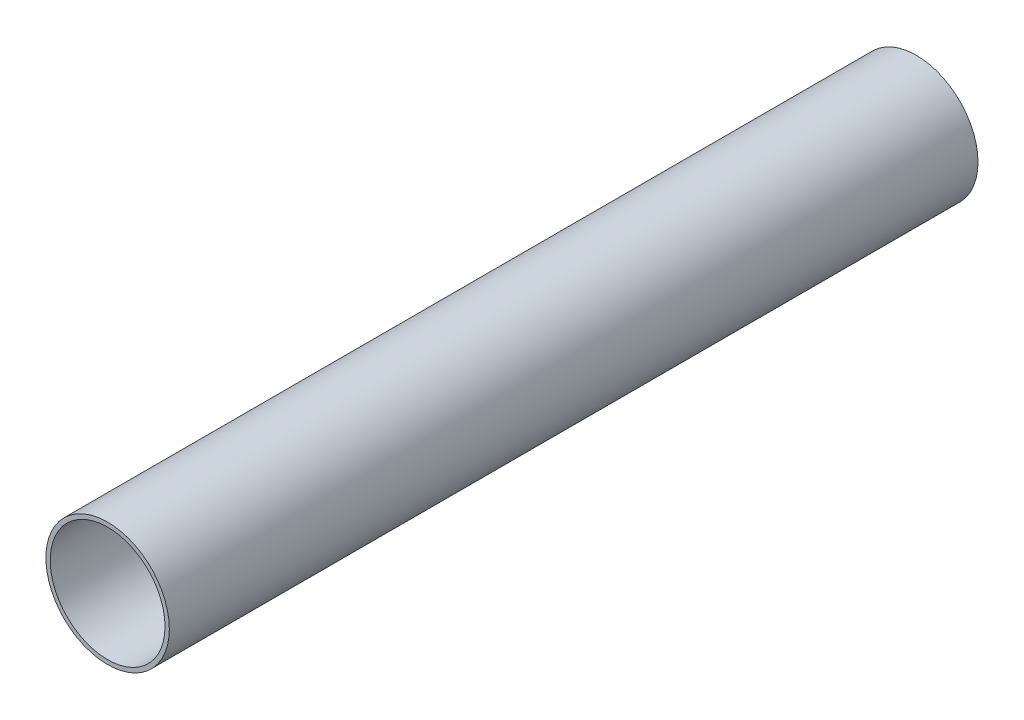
from build123d import *

# Parameters (mm, degrees)
SKETCH1_R      = 29.083
SKETCH1_R_2    = 27.051
EXTRUDE2_DEPTH = 381


with BuildPart() as part:
    # Sketch1 → Extrude2 (new body)
    with BuildSketch(Plane.XY):
        Circle(SKETCH1_R)
        Circle(SKETCH1_R_2, mode=Mode.SUBTRACT)
    extrude(amount=EXTRUDE2_DEPTH)


solid = part.part
